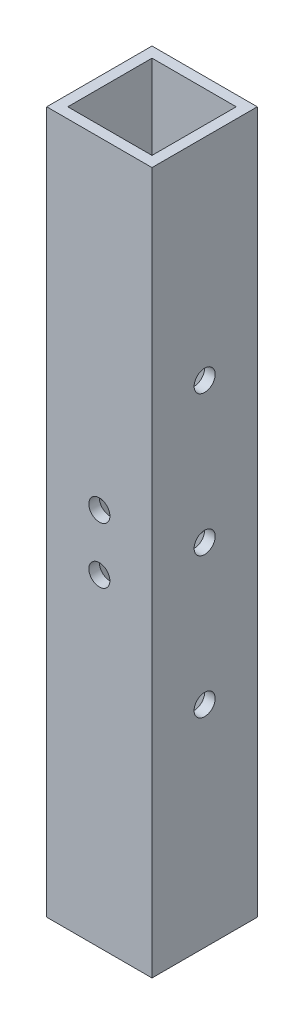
ISO-10303-21;
HEADER;
FILE_DESCRIPTION(('STEP AP214'),'2;1');
FILE_NAME('part.step','',(''),(''),'','','');
FILE_SCHEMA(('AUTOMOTIVE_DESIGN { 1 0 10303 214 1 1 1 1 }'));
ENDSEC;
DATA;
#1=APPLICATION_CONTEXT('core data for automotive mechanical design processes');
#2=APPLICATION_PROTOCOL_DEFINITION('international standard','automotive_design',2000,#1);
#3=PRODUCT_CONTEXT('',#1,'mechanical');
#4=PRODUCT('Part','Part','',(#3));
#5=PRODUCT_RELATED_PRODUCT_CATEGORY('part','',(#4));
#6=PRODUCT_DEFINITION_FORMATION('','',#4);
#7=PRODUCT_DEFINITION_CONTEXT('part definition',#1,'design');
#8=PRODUCT_DEFINITION('design','',#6,#7);
#9=PRODUCT_DEFINITION_SHAPE('','',#8);
#10=(LENGTH_UNIT() NAMED_UNIT(*) SI_UNIT(.MILLI.,.METRE.));
#11=(NAMED_UNIT(*) PLANE_ANGLE_UNIT() SI_UNIT($,.RADIAN.));
#12=(NAMED_UNIT(*) SI_UNIT($,.STERADIAN.) SOLID_ANGLE_UNIT());
#13=UNCERTAINTY_MEASURE_WITH_UNIT(LENGTH_MEASURE(1.E-05),#10,'distance_accuracy_value','');
#14=(GEOMETRIC_REPRESENTATION_CONTEXT(3) GLOBAL_UNCERTAINTY_ASSIGNED_CONTEXT((#13)) GLOBAL_UNIT_ASSIGNED_CONTEXT((#10,
#11,#12)) REPRESENTATION_CONTEXT('',''));
#15=CARTESIAN_POINT('',(0.,0.,0.));
#16=DIRECTION('',(0.,0.,1.));
#17=DIRECTION('',(1.,0.,0.));
#18=AXIS2_PLACEMENT_3D('',#15,#16,#17);
#19=CARTESIAN_POINT('',(0.,100.,0.));
#20=DIRECTION('',(0.,-1.,0.));
#21=DIRECTION('',(0.,0.,-1.));
#22=AXIS2_PLACEMENT_3D('',#19,#20,#21);
#23=PLANE('',#22);
#24=DIRECTION('',(0.,0.,1.));
#25=VECTOR('',#24,1.);
#26=CARTESIAN_POINT('',(0.,100.,0.));
#27=LINE('',#26,#25);
#28=CARTESIAN_POINT('',(0.,100.,-15.));
#29=VERTEX_POINT('',#28);
#30=CARTESIAN_POINT('',(0.,100.,0.));
#31=VERTEX_POINT('',#30);
#32=EDGE_CURVE('E139',#29,#31,#27,.T.);
#33=ORIENTED_EDGE('',*,*,#32,.T.);
#34=DIRECTION('',(1.,0.,0.));
#35=VECTOR('',#34,1.);
#36=CARTESIAN_POINT('',(0.,100.,0.));
#37=LINE('',#36,#35);
#38=CARTESIAN_POINT('',(15.,100.,0.));
#39=VERTEX_POINT('',#38);
#40=EDGE_CURVE('E142',#31,#39,#37,.T.);
#41=ORIENTED_EDGE('',*,*,#40,.T.);
#42=DIRECTION('',(0.,0.,-1.));
#43=VECTOR('',#42,1.);
#44=CARTESIAN_POINT('',(15.,100.,0.));
#45=LINE('',#44,#43);
#46=CARTESIAN_POINT('',(15.,100.,-15.));
#47=VERTEX_POINT('',#46);
#48=EDGE_CURVE('E145',#39,#47,#45,.T.);
#49=ORIENTED_EDGE('',*,*,#48,.T.);
#50=DIRECTION('',(-1.,0.,0.));
#51=VECTOR('',#50,1.);
#52=CARTESIAN_POINT('',(0.,100.,-15.));
#53=LINE('',#52,#51);
#54=EDGE_CURVE('E147',#47,#29,#53,.T.);
#55=ORIENTED_EDGE('',*,*,#54,.T.);
#56=EDGE_LOOP('',(#33,#41,#49,#55));
#57=FACE_BOUND('',#56,.T.);
#58=DIRECTION('',(0.,0.,1.));
#59=VECTOR('',#58,1.);
#60=CARTESIAN_POINT('',(1.5,100.,-1.5));
#61=LINE('',#60,#59);
#62=CARTESIAN_POINT('',(1.5,100.,-13.5));
#63=VERTEX_POINT('',#62);
#64=CARTESIAN_POINT('',(1.5,100.,-1.5));
#65=VERTEX_POINT('',#64);
#66=EDGE_CURVE('E101',#63,#65,#61,.T.);
#67=ORIENTED_EDGE('',*,*,#66,.F.);
#68=DIRECTION('',(-1.,0.,0.));
#69=VECTOR('',#68,1.);
#70=CARTESIAN_POINT('',(1.5,100.,-13.5));
#71=LINE('',#70,#69);
#72=CARTESIAN_POINT('',(13.5,100.,-13.5));
#73=VERTEX_POINT('',#72);
#74=EDGE_CURVE('E123',#73,#63,#71,.T.);
#75=ORIENTED_EDGE('',*,*,#74,.F.);
#76=DIRECTION('',(0.,0.,-1.));
#77=VECTOR('',#76,1.);
#78=CARTESIAN_POINT('',(13.5,100.,-1.5));
#79=LINE('',#78,#77);
#80=CARTESIAN_POINT('',(13.5,100.,-1.5));
#81=VERTEX_POINT('',#80);
#82=EDGE_CURVE('E121',#81,#73,#79,.T.);
#83=ORIENTED_EDGE('',*,*,#82,.F.);
#84=DIRECTION('',(1.,0.,0.));
#85=VECTOR('',#84,1.);
#86=CARTESIAN_POINT('',(1.5,100.,-1.5));
#87=LINE('',#86,#85);
#88=EDGE_CURVE('E109',#65,#81,#87,.T.);
#89=ORIENTED_EDGE('',*,*,#88,.F.);
#90=EDGE_LOOP('',(#67,#75,#83,#89));
#91=FACE_BOUND('',#90,.T.);
#92=ADVANCED_FACE('F34',(#57,#91),#23,.F.);
#93=CARTESIAN_POINT('',(0.,0.,0.));
#94=DIRECTION('',(0.,-1.,0.));
#95=DIRECTION('',(0.,0.,-1.));
#96=AXIS2_PLACEMENT_3D('',#93,#94,#95);
#97=PLANE('',#96);
#98=DIRECTION('',(0.,0.,1.));
#99=VECTOR('',#98,1.);
#100=CARTESIAN_POINT('',(0.,0.,0.));
#101=LINE('',#100,#99);
#102=CARTESIAN_POINT('',(0.,0.,-15.));
#103=VERTEX_POINT('',#102);
#104=CARTESIAN_POINT('',(0.,0.,0.));
#105=VERTEX_POINT('',#104);
#106=EDGE_CURVE('E117',#103,#105,#101,.T.);
#107=ORIENTED_EDGE('',*,*,#106,.F.);
#108=DIRECTION('',(-1.,0.,0.));
#109=VECTOR('',#108,1.);
#110=CARTESIAN_POINT('',(0.,0.,-15.));
#111=LINE('',#110,#109);
#112=CARTESIAN_POINT('',(15.,0.,-15.));
#113=VERTEX_POINT('',#112);
#114=EDGE_CURVE('E143',#113,#103,#111,.T.);
#115=ORIENTED_EDGE('',*,*,#114,.F.);
#116=DIRECTION('',(0.,0.,-1.));
#117=VECTOR('',#116,1.);
#118=CARTESIAN_POINT('',(15.,0.,0.));
#119=LINE('',#118,#117);
#120=CARTESIAN_POINT('',(15.,0.,0.));
#121=VERTEX_POINT('',#120);
#122=EDGE_CURVE('E154',#121,#113,#119,.T.);
#123=ORIENTED_EDGE('',*,*,#122,.F.);
#124=DIRECTION('',(1.,0.,0.));
#125=VECTOR('',#124,1.);
#126=CARTESIAN_POINT('',(0.,0.,0.));
#127=LINE('',#126,#125);
#128=EDGE_CURVE('E152',#105,#121,#127,.T.);
#129=ORIENTED_EDGE('',*,*,#128,.F.);
#130=EDGE_LOOP('',(#107,#115,#123,#129));
#131=FACE_BOUND('',#130,.T.);
#132=DIRECTION('',(-1.,0.,0.));
#133=VECTOR('',#132,1.);
#134=CARTESIAN_POINT('',(1.5,0.,-13.5));
#135=LINE('',#134,#133);
#136=CARTESIAN_POINT('',(13.5,0.,-13.5));
#137=VERTEX_POINT('',#136);
#138=CARTESIAN_POINT('',(1.5,0.,-13.5));
#139=VERTEX_POINT('',#138);
#140=EDGE_CURVE('E110',#137,#139,#135,.T.);
#141=ORIENTED_EDGE('',*,*,#140,.T.);
#142=DIRECTION('',(0.,0.,1.));
#143=VECTOR('',#142,1.);
#144=CARTESIAN_POINT('',(1.5,0.,-1.5));
#145=LINE('',#144,#143);
#146=CARTESIAN_POINT('',(1.5,0.,-1.5));
#147=VERTEX_POINT('',#146);
#148=EDGE_CURVE('E59',#139,#147,#145,.T.);
#149=ORIENTED_EDGE('',*,*,#148,.T.);
#150=DIRECTION('',(1.,0.,0.));
#151=VECTOR('',#150,1.);
#152=CARTESIAN_POINT('',(1.5,0.,-1.5));
#153=LINE('',#152,#151);
#154=CARTESIAN_POINT('',(13.5,0.,-1.5));
#155=VERTEX_POINT('',#154);
#156=EDGE_CURVE('E116',#147,#155,#153,.T.);
#157=ORIENTED_EDGE('',*,*,#156,.T.);
#158=DIRECTION('',(0.,0.,-1.));
#159=VECTOR('',#158,1.);
#160=CARTESIAN_POINT('',(13.5,0.,-1.5));
#161=LINE('',#160,#159);
#162=EDGE_CURVE('E131',#155,#137,#161,.T.);
#163=ORIENTED_EDGE('',*,*,#162,.T.);
#164=EDGE_LOOP('',(#141,#149,#157,#163));
#165=FACE_BOUND('',#164,.T.);
#166=ADVANCED_FACE('F235',(#131,#165),#97,.T.);
#167=CARTESIAN_POINT('',(0.,100.,0.));
#168=DIRECTION('',(1.,0.,0.));
#169=DIRECTION('',(0.,0.,-1.));
#170=AXIS2_PLACEMENT_3D('',#167,#168,#169);
#171=PLANE('',#170);
#172=CARTESIAN_POINT('',(0.,50.,-7.5));
#173=DIRECTION('',(1.,0.,0.));
#174=DIRECTION('',(0.,0.,-1.));
#175=AXIS2_PLACEMENT_3D('',#172,#173,#174);
#176=CIRCLE('',#175,1.49999999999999);
#177=CARTESIAN_POINT('',(0.,50.,-8.99999999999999));
#178=VERTEX_POINT('',#177);
#179=EDGE_CURVE('E318',#178,#178,#176,.T.);
#180=ORIENTED_EDGE('',*,*,#179,.T.);
#181=EDGE_LOOP('',(#180));
#182=FACE_BOUND('',#181,.T.);
#183=CARTESIAN_POINT('',(0.,70.,-7.5));
#184=DIRECTION('',(1.,0.,0.));
#185=DIRECTION('',(0.,0.,-1.));
#186=AXIS2_PLACEMENT_3D('',#183,#184,#185);
#187=CIRCLE('',#186,1.5);
#188=CARTESIAN_POINT('',(0.,70.,-9.00000000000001));
#189=VERTEX_POINT('',#188);
#190=EDGE_CURVE('E180',#189,#189,#187,.T.);
#191=ORIENTED_EDGE('',*,*,#190,.T.);
#192=EDGE_LOOP('',(#191));
#193=FACE_BOUND('',#192,.T.);
#194=CARTESIAN_POINT('',(0.,30.,-7.50000000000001));
#195=DIRECTION('',(1.,0.,0.));
#196=DIRECTION('',(0.,0.,-1.));
#197=AXIS2_PLACEMENT_3D('',#194,#195,#196);
#198=CIRCLE('',#197,1.5);
#199=CARTESIAN_POINT('',(0.,30.,-9.00000000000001));
#200=VERTEX_POINT('',#199);
#201=EDGE_CURVE('E176',#200,#200,#198,.T.);
#202=ORIENTED_EDGE('',*,*,#201,.T.);
#203=EDGE_LOOP('',(#202));
#204=FACE_BOUND('',#203,.T.);
#205=ORIENTED_EDGE('',*,*,#106,.T.);
#206=DIRECTION('',(0.,-1.,0.));
#207=VECTOR('',#206,1.);
#208=CARTESIAN_POINT('',(0.,100.,0.));
#209=LINE('',#208,#207);
#210=EDGE_CURVE('E11',#31,#105,#209,.T.);
#211=ORIENTED_EDGE('',*,*,#210,.F.);
#212=ORIENTED_EDGE('',*,*,#32,.F.);
#213=DIRECTION('',(0.,-1.,0.));
#214=VECTOR('',#213,1.);
#215=CARTESIAN_POINT('',(0.,100.,-15.));
#216=LINE('',#215,#214);
#217=EDGE_CURVE('E149',#29,#103,#216,.T.);
#218=ORIENTED_EDGE('',*,*,#217,.T.);
#219=EDGE_LOOP('',(#205,#211,#212,#218));
#220=FACE_BOUND('',#219,.T.);
#221=ADVANCED_FACE('F36',(#182,#193,#204,#220),#171,.F.);
#222=CARTESIAN_POINT('',(0.,100.,0.));
#223=DIRECTION('',(0.,0.,-1.));
#224=DIRECTION('',(-1.,0.,0.));
#225=AXIS2_PLACEMENT_3D('',#222,#223,#224);
#226=PLANE('',#225);
#227=CARTESIAN_POINT('',(7.50000000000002,46.,0.));
#228=DIRECTION('',(0.,0.,1.));
#229=DIRECTION('',(1.,0.,0.));
#230=AXIS2_PLACEMENT_3D('',#227,#228,#229);
#231=CIRCLE('',#230,1.5);
#232=CARTESIAN_POINT('',(9.00000000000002,46.,0.));
#233=VERTEX_POINT('',#232);
#234=EDGE_CURVE('E202',#233,#233,#231,.T.);
#235=ORIENTED_EDGE('',*,*,#234,.F.);
#236=EDGE_LOOP('',(#235));
#237=FACE_BOUND('',#236,.T.);
#238=CARTESIAN_POINT('',(7.50000000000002,54.,0.));
#239=DIRECTION('',(0.,0.,1.));
#240=DIRECTION('',(1.,0.,0.));
#241=AXIS2_PLACEMENT_3D('',#238,#239,#240);
#242=CIRCLE('',#241,1.5);
#243=CARTESIAN_POINT('',(9.00000000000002,54.,0.));
#244=VERTEX_POINT('',#243);
#245=EDGE_CURVE('E209',#244,#244,#242,.T.);
#246=ORIENTED_EDGE('',*,*,#245,.F.);
#247=EDGE_LOOP('',(#246));
#248=FACE_BOUND('',#247,.T.);
#249=ORIENTED_EDGE('',*,*,#128,.T.);
#250=DIRECTION('',(0.,-1.,0.));
#251=VECTOR('',#250,1.);
#252=CARTESIAN_POINT('',(15.,100.,0.));
#253=LINE('',#252,#251);
#254=EDGE_CURVE('E43',#39,#121,#253,.T.);
#255=ORIENTED_EDGE('',*,*,#254,.F.);
#256=ORIENTED_EDGE('',*,*,#40,.F.);
#257=ORIENTED_EDGE('',*,*,#210,.T.);
#258=EDGE_LOOP('',(#249,#255,#256,#257));
#259=FACE_BOUND('',#258,.T.);
#260=ADVANCED_FACE('F249',(#237,#248,#259),#226,.F.);
#261=CARTESIAN_POINT('',(15.,100.,0.));
#262=DIRECTION('',(-1.,0.,0.));
#263=DIRECTION('',(0.,0.,1.));
#264=AXIS2_PLACEMENT_3D('',#261,#262,#263);
#265=PLANE('',#264);
#266=CARTESIAN_POINT('',(15.,50.,-7.5));
#267=DIRECTION('',(1.,0.,0.));
#268=DIRECTION('',(0.,0.,-1.));
#269=AXIS2_PLACEMENT_3D('',#266,#267,#268);
#270=CIRCLE('',#269,1.49999999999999);
#271=CARTESIAN_POINT('',(15.,50.,-8.99999999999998));
#272=VERTEX_POINT('',#271);
#273=EDGE_CURVE('E317',#272,#272,#270,.T.);
#274=ORIENTED_EDGE('',*,*,#273,.F.);
#275=EDGE_LOOP('',(#274));
#276=FACE_BOUND('',#275,.T.);
#277=CARTESIAN_POINT('',(15.,70.,-7.5));
#278=DIRECTION('',(1.,0.,0.));
#279=DIRECTION('',(0.,0.,-1.));
#280=AXIS2_PLACEMENT_3D('',#277,#278,#279);
#281=CIRCLE('',#280,1.5);
#282=CARTESIAN_POINT('',(15.,70.,-9.00000000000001));
#283=VERTEX_POINT('',#282);
#284=EDGE_CURVE('E187',#283,#283,#281,.T.);
#285=ORIENTED_EDGE('',*,*,#284,.F.);
#286=EDGE_LOOP('',(#285));
#287=FACE_BOUND('',#286,.T.);
#288=CARTESIAN_POINT('',(15.,30.,-7.50000000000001));
#289=DIRECTION('',(1.,0.,0.));
#290=DIRECTION('',(0.,0.,-1.));
#291=AXIS2_PLACEMENT_3D('',#288,#289,#290);
#292=CIRCLE('',#291,1.5);
#293=CARTESIAN_POINT('',(15.,30.,-9.00000000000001));
#294=VERTEX_POINT('',#293);
#295=EDGE_CURVE('E184',#294,#294,#292,.T.);
#296=ORIENTED_EDGE('',*,*,#295,.F.);
#297=EDGE_LOOP('',(#296));
#298=FACE_BOUND('',#297,.T.);
#299=ORIENTED_EDGE('',*,*,#122,.T.);
#300=DIRECTION('',(0.,-1.,0.));
#301=VECTOR('',#300,1.);
#302=CARTESIAN_POINT('',(15.,100.,-15.));
#303=LINE('',#302,#301);
#304=EDGE_CURVE('E159',#47,#113,#303,.T.);
#305=ORIENTED_EDGE('',*,*,#304,.F.);
#306=ORIENTED_EDGE('',*,*,#48,.F.);
#307=ORIENTED_EDGE('',*,*,#254,.T.);
#308=EDGE_LOOP('',(#299,#305,#306,#307));
#309=FACE_BOUND('',#308,.T.);
#310=ADVANCED_FACE('F246',(#276,#287,#298,#309),#265,.F.);
#311=CARTESIAN_POINT('',(0.,100.,-15.));
#312=DIRECTION('',(0.,0.,1.));
#313=DIRECTION('',(1.,0.,0.));
#314=AXIS2_PLACEMENT_3D('',#311,#312,#313);
#315=PLANE('',#314);
#316=CARTESIAN_POINT('',(7.50000000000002,46.,-15.));
#317=DIRECTION('',(0.,0.,1.));
#318=DIRECTION('',(1.,0.,0.));
#319=AXIS2_PLACEMENT_3D('',#316,#317,#318);
#320=CIRCLE('',#319,1.5);
#321=CARTESIAN_POINT('',(9.00000000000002,46.,-15.));
#322=VERTEX_POINT('',#321);
#323=EDGE_CURVE('E172',#322,#322,#320,.F.);
#324=ORIENTED_EDGE('',*,*,#323,.F.);
#325=EDGE_LOOP('',(#324));
#326=FACE_BOUND('',#325,.T.);
#327=CARTESIAN_POINT('',(7.50000000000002,54.,-15.));
#328=DIRECTION('',(0.,0.,1.));
#329=DIRECTION('',(1.,0.,0.));
#330=AXIS2_PLACEMENT_3D('',#327,#328,#329);
#331=CIRCLE('',#330,1.5);
#332=CARTESIAN_POINT('',(9.00000000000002,54.,-15.));
#333=VERTEX_POINT('',#332);
#334=EDGE_CURVE('E167',#333,#333,#331,.F.);
#335=ORIENTED_EDGE('',*,*,#334,.F.);
#336=EDGE_LOOP('',(#335));
#337=FACE_BOUND('',#336,.T.);
#338=ORIENTED_EDGE('',*,*,#114,.T.);
#339=ORIENTED_EDGE('',*,*,#217,.F.);
#340=ORIENTED_EDGE('',*,*,#54,.F.);
#341=ORIENTED_EDGE('',*,*,#304,.T.);
#342=EDGE_LOOP('',(#338,#339,#340,#341));
#343=FACE_BOUND('',#342,.T.);
#344=ADVANCED_FACE('F230',(#326,#337,#343),#315,.F.);
#345=CARTESIAN_POINT('',(1.5,100.,-1.5));
#346=DIRECTION('',(1.,0.,0.));
#347=DIRECTION('',(0.,0.,-1.));
#348=AXIS2_PLACEMENT_3D('',#345,#346,#347);
#349=PLANE('',#348);
#350=CARTESIAN_POINT('',(1.5,50.,-7.5));
#351=DIRECTION('',(1.,0.,0.));
#352=DIRECTION('',(0.,0.,-1.));
#353=AXIS2_PLACEMENT_3D('',#350,#351,#352);
#354=CIRCLE('',#353,1.49999999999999);
#355=CARTESIAN_POINT('',(1.5,50.,-8.99999999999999));
#356=VERTEX_POINT('',#355);
#357=EDGE_CURVE('E192',#356,#356,#354,.T.);
#358=ORIENTED_EDGE('',*,*,#357,.F.);
#359=EDGE_LOOP('',(#358));
#360=FACE_BOUND('',#359,.T.);
#361=CARTESIAN_POINT('',(1.5,70.,-7.5));
#362=DIRECTION('',(1.,0.,0.));
#363=DIRECTION('',(0.,0.,-1.));
#364=AXIS2_PLACEMENT_3D('',#361,#362,#363);
#365=CIRCLE('',#364,1.5);
#366=CARTESIAN_POINT('',(1.5,70.,-9.00000000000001));
#367=VERTEX_POINT('',#366);
#368=EDGE_CURVE('E179',#367,#367,#365,.T.);
#369=ORIENTED_EDGE('',*,*,#368,.F.);
#370=EDGE_LOOP('',(#369));
#371=FACE_BOUND('',#370,.T.);
#372=CARTESIAN_POINT('',(1.5,30.,-7.50000000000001));
#373=DIRECTION('',(1.,0.,0.));
#374=DIRECTION('',(0.,0.,-1.));
#375=AXIS2_PLACEMENT_3D('',#372,#373,#374);
#376=CIRCLE('',#375,1.5);
#377=CARTESIAN_POINT('',(1.5,30.,-9.00000000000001));
#378=VERTEX_POINT('',#377);
#379=EDGE_CURVE('E175',#378,#378,#376,.T.);
#380=ORIENTED_EDGE('',*,*,#379,.F.);
#381=EDGE_LOOP('',(#380));
#382=FACE_BOUND('',#381,.T.);
#383=ORIENTED_EDGE('',*,*,#148,.F.);
#384=DIRECTION('',(0.,-1.,0.));
#385=VECTOR('',#384,1.);
#386=CARTESIAN_POINT('',(1.5,100.,-13.5));
#387=LINE('',#386,#385);
#388=EDGE_CURVE('E105',#63,#139,#387,.T.);
#389=ORIENTED_EDGE('',*,*,#388,.F.);
#390=ORIENTED_EDGE('',*,*,#66,.T.);
#391=DIRECTION('',(0.,-1.,0.));
#392=VECTOR('',#391,1.);
#393=CARTESIAN_POINT('',(1.5,100.,-1.5));
#394=LINE('',#393,#392);
#395=EDGE_CURVE('E104',#65,#147,#394,.T.);
#396=ORIENTED_EDGE('',*,*,#395,.T.);
#397=EDGE_LOOP('',(#383,#389,#390,#396));
#398=FACE_BOUND('',#397,.T.);
#399=ADVANCED_FACE('F103',(#360,#371,#382,#398),#349,.T.);
#400=CARTESIAN_POINT('',(1.5,100.,-1.5));
#401=DIRECTION('',(0.,0.,-1.));
#402=DIRECTION('',(-1.,0.,0.));
#403=AXIS2_PLACEMENT_3D('',#400,#401,#402);
#404=PLANE('',#403);
#405=CARTESIAN_POINT('',(7.50000000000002,46.,-1.5));
#406=DIRECTION('',(0.,0.,-1.));
#407=DIRECTION('',(-1.,0.,0.));
#408=AXIS2_PLACEMENT_3D('',#405,#406,#407);
#409=CIRCLE('',#408,1.5);
#410=CARTESIAN_POINT('',(6.00000000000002,46.,-1.5));
#411=VERTEX_POINT('',#410);
#412=EDGE_CURVE('E171',#411,#411,#409,.T.);
#413=ORIENTED_EDGE('',*,*,#412,.F.);
#414=EDGE_LOOP('',(#413));
#415=FACE_BOUND('',#414,.T.);
#416=CARTESIAN_POINT('',(7.50000000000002,54.,-1.5));
#417=DIRECTION('',(0.,0.,-1.));
#418=DIRECTION('',(-1.,0.,0.));
#419=AXIS2_PLACEMENT_3D('',#416,#417,#418);
#420=CIRCLE('',#419,1.5);
#421=CARTESIAN_POINT('',(6.00000000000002,54.,-1.5));
#422=VERTEX_POINT('',#421);
#423=EDGE_CURVE('E129',#422,#422,#420,.T.);
#424=ORIENTED_EDGE('',*,*,#423,.F.);
#425=EDGE_LOOP('',(#424));
#426=FACE_BOUND('',#425,.T.);
#427=ORIENTED_EDGE('',*,*,#156,.F.);
#428=ORIENTED_EDGE('',*,*,#395,.F.);
#429=ORIENTED_EDGE('',*,*,#88,.T.);
#430=DIRECTION('',(0.,-1.,0.));
#431=VECTOR('',#430,1.);
#432=CARTESIAN_POINT('',(13.5,100.,-1.5));
#433=LINE('',#432,#431);
#434=EDGE_CURVE('E118',#81,#155,#433,.T.);
#435=ORIENTED_EDGE('',*,*,#434,.T.);
#436=EDGE_LOOP('',(#427,#428,#429,#435));
#437=FACE_BOUND('',#436,.T.);
#438=ADVANCED_FACE('F113',(#415,#426,#437),#404,.T.);
#439=CARTESIAN_POINT('',(13.5,100.,-1.5));
#440=DIRECTION('',(-1.,0.,0.));
#441=DIRECTION('',(0.,0.,1.));
#442=AXIS2_PLACEMENT_3D('',#439,#440,#441);
#443=PLANE('',#442);
#444=CARTESIAN_POINT('',(13.5,50.,-7.5));
#445=DIRECTION('',(-1.,0.,0.));
#446=DIRECTION('',(0.,0.,1.));
#447=AXIS2_PLACEMENT_3D('',#444,#445,#446);
#448=CIRCLE('',#447,1.49999999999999);
#449=CARTESIAN_POINT('',(13.5,50.,-6.00000000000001));
#450=VERTEX_POINT('',#449);
#451=EDGE_CURVE('E38',#450,#450,#448,.T.);
#452=ORIENTED_EDGE('',*,*,#451,.F.);
#453=EDGE_LOOP('',(#452));
#454=FACE_BOUND('',#453,.T.);
#455=CARTESIAN_POINT('',(13.5,70.,-7.5));
#456=DIRECTION('',(-1.,0.,0.));
#457=DIRECTION('',(0.,0.,1.));
#458=AXIS2_PLACEMENT_3D('',#455,#456,#457);
#459=CIRCLE('',#458,1.5);
#460=CARTESIAN_POINT('',(13.5,70.,-6.));
#461=VERTEX_POINT('',#460);
#462=EDGE_CURVE('E177',#461,#461,#459,.T.);
#463=ORIENTED_EDGE('',*,*,#462,.F.);
#464=EDGE_LOOP('',(#463));
#465=FACE_BOUND('',#464,.T.);
#466=CARTESIAN_POINT('',(13.5,30.,-7.50000000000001));
#467=DIRECTION('',(-1.,0.,0.));
#468=DIRECTION('',(0.,0.,1.));
#469=AXIS2_PLACEMENT_3D('',#466,#467,#468);
#470=CIRCLE('',#469,1.5);
#471=CARTESIAN_POINT('',(13.5,30.,-6.00000000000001));
#472=VERTEX_POINT('',#471);
#473=EDGE_CURVE('E173',#472,#472,#470,.T.);
#474=ORIENTED_EDGE('',*,*,#473,.F.);
#475=EDGE_LOOP('',(#474));
#476=FACE_BOUND('',#475,.T.);
#477=ORIENTED_EDGE('',*,*,#162,.F.);
#478=ORIENTED_EDGE('',*,*,#434,.F.);
#479=ORIENTED_EDGE('',*,*,#82,.T.);
#480=DIRECTION('',(0.,-1.,0.));
#481=VECTOR('',#480,1.);
#482=CARTESIAN_POINT('',(13.5,100.,-13.5));
#483=LINE('',#482,#481);
#484=EDGE_CURVE('E51',#73,#137,#483,.T.);
#485=ORIENTED_EDGE('',*,*,#484,.T.);
#486=EDGE_LOOP('',(#477,#478,#479,#485));
#487=FACE_BOUND('',#486,.T.);
#488=ADVANCED_FACE('F220',(#454,#465,#476,#487),#443,.T.);
#489=CARTESIAN_POINT('',(1.5,100.,-13.5));
#490=DIRECTION('',(0.,0.,1.));
#491=DIRECTION('',(1.,0.,0.));
#492=AXIS2_PLACEMENT_3D('',#489,#490,#491);
#493=PLANE('',#492);
#494=CARTESIAN_POINT('',(7.50000000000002,46.,-13.5));
#495=DIRECTION('',(0.,0.,1.));
#496=DIRECTION('',(1.,0.,0.));
#497=AXIS2_PLACEMENT_3D('',#494,#495,#496);
#498=CIRCLE('',#497,1.5);
#499=CARTESIAN_POINT('',(9.00000000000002,46.,-13.5));
#500=VERTEX_POINT('',#499);
#501=EDGE_CURVE('E168',#500,#500,#498,.T.);
#502=ORIENTED_EDGE('',*,*,#501,.F.);
#503=EDGE_LOOP('',(#502));
#504=FACE_BOUND('',#503,.T.);
#505=CARTESIAN_POINT('',(7.50000000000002,54.,-13.5));
#506=DIRECTION('',(0.,0.,1.));
#507=DIRECTION('',(1.,0.,0.));
#508=AXIS2_PLACEMENT_3D('',#505,#506,#507);
#509=CIRCLE('',#508,1.5);
#510=CARTESIAN_POINT('',(9.00000000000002,54.,-13.5));
#511=VERTEX_POINT('',#510);
#512=EDGE_CURVE('E164',#511,#511,#509,.T.);
#513=ORIENTED_EDGE('',*,*,#512,.F.);
#514=EDGE_LOOP('',(#513));
#515=FACE_BOUND('',#514,.T.);
#516=ORIENTED_EDGE('',*,*,#140,.F.);
#517=ORIENTED_EDGE('',*,*,#484,.F.);
#518=ORIENTED_EDGE('',*,*,#74,.T.);
#519=ORIENTED_EDGE('',*,*,#388,.T.);
#520=EDGE_LOOP('',(#516,#517,#518,#519));
#521=FACE_BOUND('',#520,.T.);
#522=ADVANCED_FACE('F227',(#504,#515,#521),#493,.T.);
#523=CARTESIAN_POINT('',(7.50000000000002,54.,-19.2426406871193));
#524=DIRECTION('',(0.,0.,1.));
#525=DIRECTION('',(1.,0.,0.));
#526=AXIS2_PLACEMENT_3D('',#523,#524,#525);
#527=CYLINDRICAL_SURFACE('',#526,1.5);
#528=ORIENTED_EDGE('',*,*,#512,.T.);
#529=EDGE_LOOP('',(#528));
#530=FACE_BOUND('',#529,.T.);
#531=ORIENTED_EDGE('',*,*,#334,.T.);
#532=EDGE_LOOP('',(#531));
#533=FACE_BOUND('',#532,.T.);
#534=ADVANCED_FACE('F277',(#530,#533),#527,.F.);
#535=ORIENTED_EDGE('',*,*,#423,.T.);
#536=EDGE_LOOP('',(#535));
#537=FACE_BOUND('',#536,.T.);
#538=ORIENTED_EDGE('',*,*,#245,.T.);
#539=EDGE_LOOP('',(#538));
#540=FACE_BOUND('',#539,.T.);
#541=ADVANCED_FACE('F216',(#537,#540),#527,.F.);
#542=CARTESIAN_POINT('',(7.50000000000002,46.,-19.2426406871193));
#543=DIRECTION('',(0.,0.,1.));
#544=DIRECTION('',(1.,0.,0.));
#545=AXIS2_PLACEMENT_3D('',#542,#543,#544);
#546=CYLINDRICAL_SURFACE('',#545,1.5);
#547=ORIENTED_EDGE('',*,*,#501,.T.);
#548=EDGE_LOOP('',(#547));
#549=FACE_BOUND('',#548,.T.);
#550=ORIENTED_EDGE('',*,*,#323,.T.);
#551=EDGE_LOOP('',(#550));
#552=FACE_BOUND('',#551,.T.);
#553=ADVANCED_FACE('F288',(#549,#552),#546,.F.);
#554=ORIENTED_EDGE('',*,*,#412,.T.);
#555=EDGE_LOOP('',(#554));
#556=FACE_BOUND('',#555,.T.);
#557=ORIENTED_EDGE('',*,*,#234,.T.);
#558=EDGE_LOOP('',(#557));
#559=FACE_BOUND('',#558,.T.);
#560=ADVANCED_FACE('F291',(#556,#559),#546,.F.);
#561=CARTESIAN_POINT('',(15.,30.,-7.50000000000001));
#562=DIRECTION('',(1.,0.,0.));
#563=DIRECTION('',(0.,0.,-1.));
#564=AXIS2_PLACEMENT_3D('',#561,#562,#563);
#565=CYLINDRICAL_SURFACE('',#564,1.5);
#566=ORIENTED_EDGE('',*,*,#473,.T.);
#567=EDGE_LOOP('',(#566));
#568=FACE_BOUND('',#567,.T.);
#569=ORIENTED_EDGE('',*,*,#295,.T.);
#570=EDGE_LOOP('',(#569));
#571=FACE_BOUND('',#570,.T.);
#572=ADVANCED_FACE('F293',(#568,#571),#565,.F.);
#573=ORIENTED_EDGE('',*,*,#379,.T.);
#574=EDGE_LOOP('',(#573));
#575=FACE_BOUND('',#574,.T.);
#576=ORIENTED_EDGE('',*,*,#201,.F.);
#577=EDGE_LOOP('',(#576));
#578=FACE_BOUND('',#577,.T.);
#579=ADVANCED_FACE('F296',(#575,#578),#565,.F.);
#580=CARTESIAN_POINT('',(15.,70.,-7.5));
#581=DIRECTION('',(1.,0.,0.));
#582=DIRECTION('',(0.,0.,-1.));
#583=AXIS2_PLACEMENT_3D('',#580,#581,#582);
#584=CYLINDRICAL_SURFACE('',#583,1.5);
#585=ORIENTED_EDGE('',*,*,#462,.T.);
#586=EDGE_LOOP('',(#585));
#587=FACE_BOUND('',#586,.T.);
#588=ORIENTED_EDGE('',*,*,#284,.T.);
#589=EDGE_LOOP('',(#588));
#590=FACE_BOUND('',#589,.T.);
#591=ADVANCED_FACE('F298',(#587,#590),#584,.F.);
#592=ORIENTED_EDGE('',*,*,#368,.T.);
#593=EDGE_LOOP('',(#592));
#594=FACE_BOUND('',#593,.T.);
#595=ORIENTED_EDGE('',*,*,#190,.F.);
#596=EDGE_LOOP('',(#595));
#597=FACE_BOUND('',#596,.T.);
#598=ADVANCED_FACE('F301',(#594,#597),#584,.F.);
#599=CARTESIAN_POINT('',(15.,50.,-7.5));
#600=DIRECTION('',(1.,0.,0.));
#601=DIRECTION('',(0.,0.,-1.));
#602=AXIS2_PLACEMENT_3D('',#599,#600,#601);
#603=CYLINDRICAL_SURFACE('',#602,1.49999999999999);
#604=ORIENTED_EDGE('',*,*,#451,.T.);
#605=EDGE_LOOP('',(#604));
#606=FACE_BOUND('',#605,.T.);
#607=ORIENTED_EDGE('',*,*,#273,.T.);
#608=EDGE_LOOP('',(#607));
#609=FACE_BOUND('',#608,.T.);
#610=ADVANCED_FACE('F302',(#606,#609),#603,.F.);
#611=ORIENTED_EDGE('',*,*,#357,.T.);
#612=EDGE_LOOP('',(#611));
#613=FACE_BOUND('',#612,.T.);
#614=ORIENTED_EDGE('',*,*,#179,.F.);
#615=EDGE_LOOP('',(#614));
#616=FACE_BOUND('',#615,.T.);
#617=ADVANCED_FACE('F304',(#613,#616),#603,.F.);
#618=CLOSED_SHELL('',(#92,#166,#221,#260,#310,#344,#399,#438,#488,#522,#534,#541,#553,#560,#572,
#579,#591,#598,#610,#617));
#619=MANIFOLD_SOLID_BREP('B2',#618);
#620=ADVANCED_BREP_SHAPE_REPRESENTATION('',(#18,#619),#14);
#621=SHAPE_DEFINITION_REPRESENTATION(#9,#620);
ENDSEC;
END-ISO-10303-21;
